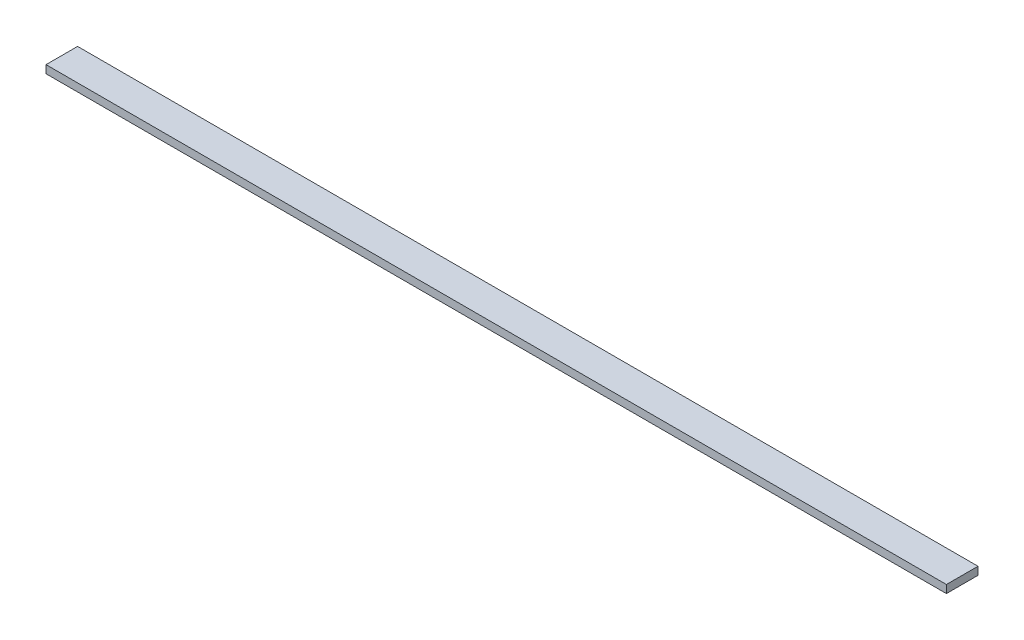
from build123d import *

# Parameters (mm, degrees)
SKETCH1_W           = 723.9
SKETCH1_H           = 25.4
BOSS_EXTRUDE1_DEPTH = 6.35


with BuildPart() as part:
    # Sketch1 → Boss-Extrude1 (new body)
    with BuildSketch(Plane(origin=(0, 0, 0), x_dir=(1, 0, 0), z_dir=(0, 1, 0))):
        Rectangle(SKETCH1_W, SKETCH1_H)
    extrude(amount=BOSS_EXTRUDE1_DEPTH)


solid = part.part
